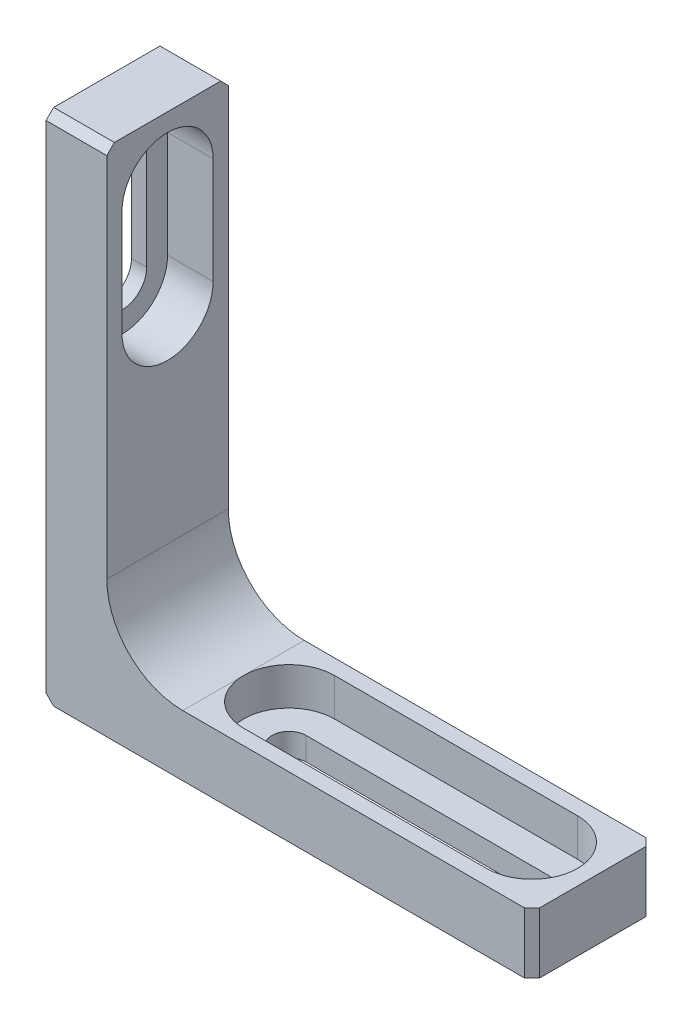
from build123d import *

# Parameters (mm, degrees)
SKETCH1_W               = 101.6
SKETCH1_H               = 106.828844
BOSS_EXTRUDE1_DEPTH     = 12.7
CUT_EXTRUDE1_DEPTH      = 148.973821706
CUT_EXTRUDE1_DEPTH_BACK = 148.973821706
CUT_EXTRUDE2_DEPTH      = 140.559671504
CUT_EXTRUDE2_DEPTH_BACK = 140.559671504
CUT_EXTRUDE3_DEPTH      = 140.083030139
CUT_EXTRUDE3_DEPTH_BACK = 140.083030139
CUT_EXTRUDE4_DEPTH      = 140.083030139
CUT_EXTRUDE4_DEPTH_BACK = 7.874
CHAMFER1_SIZE           = 1.5875
CUT_EXTRUDE5_DEPTH      = 140.559671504
CUT_EXTRUDE5_DEPTH_BACK = 9.525


with BuildPart() as part:
    # Sketch1 → Boss-Extrude1 (new, symmetric)
    with BuildSketch(Plane.XY):
        with Locations((50.8, 53.414422)):
            Rectangle(SKETCH1_W, SKETCH1_H)
    extrude(amount=BOSS_EXTRUDE1_DEPTH, both=True)

    # Sketch2 → Cut-Extrude1 (cut, two sides: drawn at the far end of the back side and taken through both)
    with BuildSketch(Plane.XY.offset(-CUT_EXTRUDE1_DEPTH_BACK)):
        with BuildLine():
            Line((101.6, 106.828844), (12.7, 106.828844))
            Line((12.7, 106.828844), (12.7, 28.575))
            ThreePointArc((12.7, 28.575), (17.349679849, 17.349679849), (28.575, 12.7))
            Line((28.575, 12.7), (101.6, 12.7))
            Line((101.6, 12.7), (101.6, 106.828844))
        make_face()
    extrude(amount=CUT_EXTRUDE1_DEPTH + CUT_EXTRUDE1_DEPTH_BACK, mode=Mode.SUBTRACT)

    # Sketch3 → Cut-Extrude2 (cut, two sides: drawn at the far end of the back side and taken through both)
    with BuildSketch(Plane(origin=(12.7, 0, 0), x_dir=(0, 0, -1), z_dir=(1, 0, 0)).offset(-CUT_EXTRUDE2_DEPTH_BACK)):
        with BuildLine():
            Line((-5.1562, 71.332344), (-5.1562, 93.557344))
            ThreePointArc((-5.1562, 93.557344), (0, 98.713544), (5.1562, 93.557344))
            Line((5.1562, 93.557344), (5.1562, 71.332344))
            ThreePointArc((5.1562, 71.332344), (0, 66.176144), (-5.1562, 71.332344))
        make_face()
    extrude(amount=CUT_EXTRUDE2_DEPTH + CUT_EXTRUDE2_DEPTH_BACK, mode=Mode.SUBTRACT)

    # Sketch4 → Cut-Extrude3 (cut, two sides: drawn at the far end of the back side and taken through both)
    with BuildSketch(Plane(origin=(0, 12.7, 0), x_dir=(1, 0, 0), z_dir=(0, 1, 0)).offset(-CUT_EXTRUDE3_DEPTH_BACK)):
        with BuildLine():
            Line((38.1, 3.5687), (88.9, 3.5687))
            ThreePointArc((88.9, 3.5687), (92.4687, 0), (88.9, -3.5687))
            Line((88.9, -3.5687), (38.1, -3.5687))
            ThreePointArc((38.1, -3.5687), (34.5313, 0), (38.1, 3.5687))
        make_face()
    extrude(amount=CUT_EXTRUDE3_DEPTH + CUT_EXTRUDE3_DEPTH_BACK, mode=Mode.SUBTRACT)

    # Sketch5 → Cut-Extrude4 (cut, two sides: drawn at the far end of the back side and taken through both)
    with BuildSketch(Plane(origin=(0, 12.7, 0), x_dir=(1, 0, 0), z_dir=(0, 1, 0)).offset(-CUT_EXTRUDE4_DEPTH_BACK)):
        with BuildLine():
            Line((38.1, 9.525), (88.9, 9.525))
            ThreePointArc((88.9, 9.525), (98.425, 0), (88.9, -9.525))
            Line((88.9, -9.525), (38.1, -9.525))
            ThreePointArc((38.1, -9.525), (28.575, 0), (38.1, 9.525))
        make_face()
    extrude(amount=CUT_EXTRUDE4_DEPTH + CUT_EXTRUDE4_DEPTH_BACK, mode=Mode.SUBTRACT)

    # Chamfer1
    chamfer1_edges = [part.edges().sort_by_distance(p)[0] for p in [
        (101.6, 6.35, 12.7),
        (6.35, 106.828844, -12.7),
        (6.35, 106.828844, 12.7),
        (101.6, 6.35, -12.7),
        (0, 0, 0),
    ]]
    chamfer(chamfer1_edges, length=CHAMFER1_SIZE)

    # Sketch6 → Cut-Extrude5 (cut, two sides: drawn at the far end of the back side and taken through both)
    with BuildSketch(Plane(origin=(12.7, 0, 0), x_dir=(0, 0, -1), z_dir=(1, 0, 0)).offset(-CUT_EXTRUDE5_DEPTH_BACK)):
        with BuildLine():
            Line((-9.525, 71.332344), (-9.525, 93.557344))
            ThreePointArc((-9.525, 93.557344), (0, 103.082344), (9.525, 93.557344))
            Line((9.525, 93.557344), (9.525, 71.332344))
            ThreePointArc((9.525, 71.332344), (0, 61.807344), (-9.525, 71.332344))
        make_face()
    extrude(amount=CUT_EXTRUDE5_DEPTH + CUT_EXTRUDE5_DEPTH_BACK, mode=Mode.SUBTRACT)


solid = part.part
